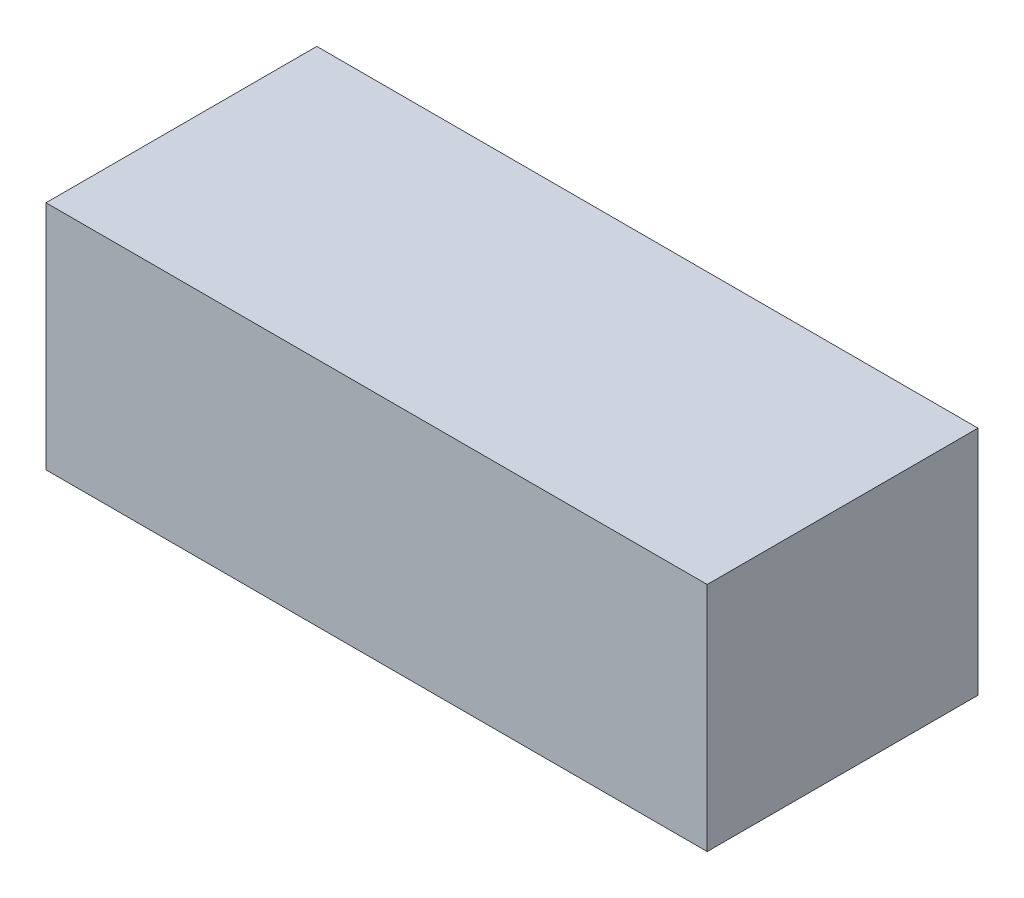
ISO-10303-21;
HEADER;
FILE_DESCRIPTION(('STEP AP214'),'2;1');
FILE_NAME('part.step','',(''),(''),'','','');
FILE_SCHEMA(('AUTOMOTIVE_DESIGN { 1 0 10303 214 1 1 1 1 }'));
ENDSEC;
DATA;
#1=APPLICATION_CONTEXT('core data for automotive mechanical design processes');
#2=APPLICATION_PROTOCOL_DEFINITION('international standard','automotive_design',2000,#1);
#3=PRODUCT_CONTEXT('',#1,'mechanical');
#4=PRODUCT('Part','Part','',(#3));
#5=PRODUCT_RELATED_PRODUCT_CATEGORY('part','',(#4));
#6=PRODUCT_DEFINITION_FORMATION('','',#4);
#7=PRODUCT_DEFINITION_CONTEXT('part definition',#1,'design');
#8=PRODUCT_DEFINITION('design','',#6,#7);
#9=PRODUCT_DEFINITION_SHAPE('','',#8);
#10=(LENGTH_UNIT() NAMED_UNIT(*) SI_UNIT(.MILLI.,.METRE.));
#11=(NAMED_UNIT(*) PLANE_ANGLE_UNIT() SI_UNIT($,.RADIAN.));
#12=(NAMED_UNIT(*) SI_UNIT($,.STERADIAN.) SOLID_ANGLE_UNIT());
#13=UNCERTAINTY_MEASURE_WITH_UNIT(LENGTH_MEASURE(1.E-05),#10,'distance_accuracy_value','');
#14=(GEOMETRIC_REPRESENTATION_CONTEXT(3) GLOBAL_UNCERTAINTY_ASSIGNED_CONTEXT((#13)) GLOBAL_UNIT_ASSIGNED_CONTEXT((#10,
#11,#12)) REPRESENTATION_CONTEXT('',''));
#15=CARTESIAN_POINT('',(0.,0.,0.));
#16=DIRECTION('',(0.,0.,1.));
#17=DIRECTION('',(1.,0.,0.));
#18=AXIS2_PLACEMENT_3D('',#15,#16,#17);
#19=CARTESIAN_POINT('',(-46.3028328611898,11.3115765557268,18.9644581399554));
#20=CARTESIAN_POINT('',(-46.3028328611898,8.56284130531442,16.5691920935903));
#21=CARTESIAN_POINT('',(-46.3028328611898,-1.00895184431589,8.2282683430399));
#22=CARTESIAN_POINT('',(-46.3028328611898,28.0136302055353,-2.1906683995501));
#23=CARTESIAN_POINT('',(-46.3028328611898,18.0505399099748,-14.1460973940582));
#24=CARTESIAN_POINT('',(-46.3028328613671,14.0351454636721,-18.9644581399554));
#25=CARTESIAN_POINT('',(-42.0859620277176,14.8657909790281,18.9644581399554));
#26=CARTESIAN_POINT('',(-41.939173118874,12.1447775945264,16.5664255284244));
#27=CARTESIAN_POINT('',(-41.4280169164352,2.66951901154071,8.21586789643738));
#28=CARTESIAN_POINT('',(-40.670869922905,29.6947584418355,-2.31325626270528));
#29=CARTESIAN_POINT('',(-40.0605118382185,19.7742895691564,-14.181311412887));
#30=CARTESIAN_POINT('',(-39.8145210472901,15.7760727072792,-18.9644581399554));
#31=CARTESIAN_POINT('',(-33.161918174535,22.3874739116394,18.9644581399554));
#32=CARTESIAN_POINT('',(-32.7431108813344,19.6859802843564,16.5605707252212));
#33=CARTESIAN_POINT('',(-31.284717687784,10.2786944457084,8.18962518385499));
#34=CARTESIAN_POINT('',(-29.1244817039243,32.8750904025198,-2.57268547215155));
#35=CARTESIAN_POINT('',(-27.3830530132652,22.8820431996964,-14.2558338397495));
#36=CARTESIAN_POINT('',(-26.6812102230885,18.8545753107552,-18.9644581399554));
#37=CARTESIAN_POINT('',(-10.2840590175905,1.15424075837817,18.9644581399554));
#38=CARTESIAN_POINT('',(-9.48633213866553,0.848685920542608,16.5463922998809));
#39=CARTESIAN_POINT('',(-6.70844486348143,-0.215333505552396,8.12607388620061));
#40=CARTESIAN_POINT('',(-2.5937163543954,23.7704347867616,-3.20093847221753));
#41=CARTESIAN_POINT('',(0.723285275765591,23.3675461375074,-14.436302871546));
#42=CARTESIAN_POINT('',(2.0601265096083,23.2051711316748,-18.9644581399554));
#43=CARTESIAN_POINT('',(16.8922424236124,30.2982164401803,18.9644581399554));
#44=CARTESIAN_POINT('',(17.5784296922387,28.8164494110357,16.5305453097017));
#45=CARTESIAN_POINT('',(19.9679077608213,23.6565608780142,8.05504365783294));
#46=CARTESIAN_POINT('',(23.5073075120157,29.3154346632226,-3.90312640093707));
#47=CARTESIAN_POINT('',(26.3605199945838,23.6056469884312,-14.6380101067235));
#48=CARTESIAN_POINT('',(27.5104416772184,21.3044483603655,-18.9644581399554));
#49=CARTESIAN_POINT('',(38.7164256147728,21.5374299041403,18.9644581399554));
#50=CARTESIAN_POINT('',(38.9282346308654,20.7977552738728,16.5177865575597));
#51=CARTESIAN_POINT('',(39.6658073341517,18.222020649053,7.99785569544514));
#52=CARTESIAN_POINT('',(40.7583323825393,17.8379369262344,-4.46847298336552));
#53=CARTESIAN_POINT('',(41.6390484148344,14.8787836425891,-14.8004089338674));
#54=CARTESIAN_POINT('',(41.9940007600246,13.6861649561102,-18.9644581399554));
#55=CARTESIAN_POINT('',(46.3028328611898,18.4920515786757,18.9644581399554));
#56=CARTESIAN_POINT('',(46.3028328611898,17.9627990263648,16.5133514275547));
#57=CARTESIAN_POINT('',(46.3028328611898,16.1198074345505,7.97797631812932));
#58=CARTESIAN_POINT('',(46.3028328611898,13.3898874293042,-4.66499577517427));
#59=CARTESIAN_POINT('',(46.3028328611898,11.1892199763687,-14.8568611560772));
#60=CARTESIAN_POINT('',(46.3028328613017,10.3022915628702,-18.9644581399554));
#61=B_SPLINE_SURFACE_WITH_KNOTS('',3,3,((#19,#20,#21,#22,#23,#24),(#25,#26,#27,#28,#29,#30),
(#31,#32,#33,#34,#35,#36),(#37,#38,#39,#40,#41,#42),(#43,#44,#45,#46,#47,#48),(#49,#50,#51,#52,
#53,#54),(#55,#56,#57,#58,#59,#60)),.UNSPECIFIED.,.F.,.F.,.F.,(4,1,1,1,4),(4,1,1,4),(0.,
0.148631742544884,0.314545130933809,0.761725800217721,1.),(0.,0.193871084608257,
0.675108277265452,1.),.UNSPECIFIED.);
#62=CARTESIAN_POINT('',(-46.3028328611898,11.3115765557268,18.9644581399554));
#63=CARTESIAN_POINT('',(-42.0859620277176,14.8657909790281,18.9644581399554));
#64=CARTESIAN_POINT('',(-33.161918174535,22.3874739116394,18.9644581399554));
#65=CARTESIAN_POINT('',(-10.2840590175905,1.15424075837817,18.9644581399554));
#66=CARTESIAN_POINT('',(16.8922424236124,30.2982164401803,18.9644581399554));
#67=CARTESIAN_POINT('',(38.7164256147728,21.5374299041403,18.9644581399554));
#68=CARTESIAN_POINT('',(46.3028328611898,18.4920515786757,18.9644581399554));
#69=B_SPLINE_CURVE_WITH_KNOTS('',3,(#62,#63,#64,#65,#66,#67,#68),.UNSPECIFIED.,.F.,.F.,(4,1,1,1,
4),(0.,0.148631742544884,0.314545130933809,0.761725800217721,1.),.UNSPECIFIED.);
#70=CARTESIAN_POINT('',(-46.3028328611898,11.3115765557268,18.9644581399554));
#71=VERTEX_POINT('',#70);
#72=CARTESIAN_POINT('',(46.3028328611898,18.4920515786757,18.9644581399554));
#73=VERTEX_POINT('',#72);
#74=EDGE_CURVE('E13',#71,#73,#69,.T.);
#75=CARTESIAN_POINT('',(46.3028328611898,18.4920515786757,18.9644581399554));
#76=CARTESIAN_POINT('',(46.3028328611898,17.9627990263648,16.5133514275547));
#77=CARTESIAN_POINT('',(46.3028328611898,16.1198074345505,7.97797631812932));
#78=CARTESIAN_POINT('',(46.3028328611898,13.3898874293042,-4.66499577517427));
#79=CARTESIAN_POINT('',(46.3028328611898,11.1892199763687,-14.8568611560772));
#80=CARTESIAN_POINT('',(46.3028328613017,10.3022915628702,-18.9644581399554));
#81=B_SPLINE_CURVE_WITH_KNOTS('',3,(#75,#76,#77,#78,#79,#80),.UNSPECIFIED.,.F.,.F.,(4,1,1,4),
(0.,0.193871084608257,0.675108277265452,1.),.UNSPECIFIED.);
#82=CARTESIAN_POINT('',(46.3028328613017,10.3022915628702,-18.9644581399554));
#83=VERTEX_POINT('',#82);
#84=EDGE_CURVE('E73',#73,#83,#81,.T.);
#85=CARTESIAN_POINT('',(-46.3028328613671,14.0351454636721,-18.9644581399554));
#86=CARTESIAN_POINT('',(-39.8145210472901,15.7760727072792,-18.9644581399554));
#87=CARTESIAN_POINT('',(-26.6812102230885,18.8545753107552,-18.9644581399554));
#88=CARTESIAN_POINT('',(2.0601265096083,23.2051711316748,-18.9644581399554));
#89=CARTESIAN_POINT('',(27.5104416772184,21.3044483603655,-18.9644581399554));
#90=CARTESIAN_POINT('',(41.9940007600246,13.6861649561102,-18.9644581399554));
#91=CARTESIAN_POINT('',(46.3028328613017,10.3022915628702,-18.9644581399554));
#92=B_SPLINE_CURVE_WITH_KNOTS('',3,(#85,#86,#87,#88,#89,#90,#91),.UNSPECIFIED.,.F.,.F.,(4,1,1,1,
4),(0.,0.148631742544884,0.314545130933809,0.761725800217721,1.),.UNSPECIFIED.);
#93=CARTESIAN_POINT('',(-46.3028328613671,14.0351454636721,-18.9644581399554));
#94=VERTEX_POINT('',#93);
#95=EDGE_CURVE('E81',#83,#94,#92,.F.);
#96=CARTESIAN_POINT('',(-46.3028328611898,11.3115765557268,18.9644581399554));
#97=CARTESIAN_POINT('',(-46.3028328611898,8.56284130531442,16.5691920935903));
#98=CARTESIAN_POINT('',(-46.3028328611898,-1.00895184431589,8.2282683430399));
#99=CARTESIAN_POINT('',(-46.3028328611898,28.0136302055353,-2.1906683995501));
#100=CARTESIAN_POINT('',(-46.3028328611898,18.0505399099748,-14.1460973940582));
#101=CARTESIAN_POINT('',(-46.3028328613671,14.0351454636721,-18.9644581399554));
#102=B_SPLINE_CURVE_WITH_KNOTS('',3,(#96,#97,#98,#99,#100,#101),.UNSPECIFIED.,.F.,.F.,(4,1,1,4),
(0.,0.193871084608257,0.675108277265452,1.),.UNSPECIFIED.);
#103=EDGE_CURVE('E65',#94,#71,#102,.F.);
#104=ORIENTED_EDGE('',*,*,#74,.T.);
#105=ORIENTED_EDGE('',*,*,#84,.T.);
#106=ORIENTED_EDGE('',*,*,#95,.T.);
#107=ORIENTED_EDGE('',*,*,#103,.T.);
#108=EDGE_LOOP('',(#104,#105,#106,#107));
#109=FACE_BOUND('',#108,.T.);
#110=ADVANCED_FACE('F62',(#109),#61,.T.);
#111=OPEN_SHELL('',(#110));
#112=SHELL_BASED_SURFACE_MODEL('B2',(#111));
#113=CARTESIAN_POINT('',(-46.3028328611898,32.4,18.9644581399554));
#114=DIRECTION('',(1.,0.,0.));
#115=DIRECTION('',(0.,0.,-1.));
#116=AXIS2_PLACEMENT_3D('',#113,#114,#115);
#117=PLANE('',#116);
#118=DIRECTION('',(0.,0.,1.));
#119=VECTOR('',#118,1.);
#120=CARTESIAN_POINT('',(-46.3028328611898,0.,18.9644581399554));
#121=LINE('',#120,#119);
#122=CARTESIAN_POINT('',(-46.3028328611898,0.,-18.9644581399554));
#123=VERTEX_POINT('',#122);
#124=CARTESIAN_POINT('',(-46.3028328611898,0.,18.9644581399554));
#125=VERTEX_POINT('',#124);
#126=EDGE_CURVE('E174',#123,#125,#121,.T.);
#127=ORIENTED_EDGE('',*,*,#126,.T.);
#128=DIRECTION('',(0.,-1.,0.));
#129=VECTOR('',#128,1.);
#130=CARTESIAN_POINT('',(-46.3028328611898,32.4,18.9644581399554));
#131=LINE('',#130,#129);
#132=CARTESIAN_POINT('',(-46.3028328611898,32.4,18.9644581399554));
#133=VERTEX_POINT('',#132);
#134=EDGE_CURVE('E60',#133,#125,#131,.T.);
#135=ORIENTED_EDGE('',*,*,#134,.F.);
#136=DIRECTION('',(0.,0.,1.));
#137=VECTOR('',#136,1.);
#138=CARTESIAN_POINT('',(-46.3028328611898,32.4,18.9644581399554));
#139=LINE('',#138,#137);
#140=CARTESIAN_POINT('',(-46.3028328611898,32.4,-18.9644581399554));
#141=VERTEX_POINT('',#140);
#142=EDGE_CURVE('E192',#141,#133,#139,.T.);
#143=ORIENTED_EDGE('',*,*,#142,.F.);
#144=DIRECTION('',(0.,-1.,0.));
#145=VECTOR('',#144,1.);
#146=CARTESIAN_POINT('',(-46.3028328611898,32.4,-18.9644581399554));
#147=LINE('',#146,#145);
#148=EDGE_CURVE('E186',#141,#123,#147,.T.);
#149=ORIENTED_EDGE('',*,*,#148,.T.);
#150=EDGE_LOOP('',(#127,#135,#143,#149));
#151=FACE_BOUND('',#150,.T.);
#152=ADVANCED_FACE('F130',(#151),#117,.F.);
#153=CARTESIAN_POINT('',(-46.3028328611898,32.4,18.9644581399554));
#154=DIRECTION('',(0.,0.,-1.));
#155=DIRECTION('',(-1.,0.,0.));
#156=AXIS2_PLACEMENT_3D('',#153,#154,#155);
#157=PLANE('',#156);
#158=DIRECTION('',(1.,0.,0.));
#159=VECTOR('',#158,1.);
#160=CARTESIAN_POINT('',(-46.3028328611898,0.,18.9644581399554));
#161=LINE('',#160,#159);
#162=CARTESIAN_POINT('',(46.3028328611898,0.,18.9644581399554));
#163=VERTEX_POINT('',#162);
#164=EDGE_CURVE('E170',#125,#163,#161,.T.);
#165=ORIENTED_EDGE('',*,*,#164,.T.);
#166=DIRECTION('',(0.,-1.,0.));
#167=VECTOR('',#166,1.);
#168=CARTESIAN_POINT('',(46.3028328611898,32.4,18.9644581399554));
#169=LINE('',#168,#167);
#170=CARTESIAN_POINT('',(46.3028328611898,32.4,18.9644581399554));
#171=VERTEX_POINT('',#170);
#172=EDGE_CURVE('E137',#171,#163,#169,.T.);
#173=ORIENTED_EDGE('',*,*,#172,.F.);
#174=DIRECTION('',(1.,0.,0.));
#175=VECTOR('',#174,1.);
#176=CARTESIAN_POINT('',(-46.3028328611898,32.4,18.9644581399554));
#177=LINE('',#176,#175);
#178=EDGE_CURVE('E182',#133,#171,#177,.T.);
#179=ORIENTED_EDGE('',*,*,#178,.F.);
#180=ORIENTED_EDGE('',*,*,#134,.T.);
#181=EDGE_LOOP('',(#165,#173,#179,#180));
#182=FACE_BOUND('',#181,.T.);
#183=ADVANCED_FACE('F181',(#182),#157,.F.);
#184=CARTESIAN_POINT('',(46.3028328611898,32.4,18.9644581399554));
#185=DIRECTION('',(-1.,0.,0.));
#186=DIRECTION('',(0.,0.,1.));
#187=AXIS2_PLACEMENT_3D('',#184,#185,#186);
#188=PLANE('',#187);
#189=DIRECTION('',(0.,0.,-1.));
#190=VECTOR('',#189,1.);
#191=CARTESIAN_POINT('',(46.3028328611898,0.,18.9644581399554));
#192=LINE('',#191,#190);
#193=CARTESIAN_POINT('',(46.3028328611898,0.,-18.9644581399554));
#194=VERTEX_POINT('',#193);
#195=EDGE_CURVE('E175',#163,#194,#192,.T.);
#196=ORIENTED_EDGE('',*,*,#195,.T.);
#197=DIRECTION('',(0.,-1.,0.));
#198=VECTOR('',#197,1.);
#199=CARTESIAN_POINT('',(46.3028328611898,32.4,-18.9644581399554));
#200=LINE('',#199,#198);
#201=CARTESIAN_POINT('',(46.3028328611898,32.4,-18.9644581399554));
#202=VERTEX_POINT('',#201);
#203=EDGE_CURVE('E198',#202,#194,#200,.T.);
#204=ORIENTED_EDGE('',*,*,#203,.F.);
#205=DIRECTION('',(0.,0.,-1.));
#206=VECTOR('',#205,1.);
#207=CARTESIAN_POINT('',(46.3028328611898,32.4,18.9644581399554));
#208=LINE('',#207,#206);
#209=EDGE_CURVE('E149',#171,#202,#208,.T.);
#210=ORIENTED_EDGE('',*,*,#209,.F.);
#211=ORIENTED_EDGE('',*,*,#172,.T.);
#212=EDGE_LOOP('',(#196,#204,#210,#211));
#213=FACE_BOUND('',#212,.T.);
#214=ADVANCED_FACE('F201',(#213),#188,.F.);
#215=CARTESIAN_POINT('',(-46.3028328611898,32.4,-18.9644581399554));
#216=DIRECTION('',(0.,0.,1.));
#217=DIRECTION('',(1.,0.,0.));
#218=AXIS2_PLACEMENT_3D('',#215,#216,#217);
#219=PLANE('',#218);
#220=DIRECTION('',(-1.,0.,0.));
#221=VECTOR('',#220,1.);
#222=CARTESIAN_POINT('',(-46.3028328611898,0.,-18.9644581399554));
#223=LINE('',#222,#221);
#224=EDGE_CURVE('E190',#194,#123,#223,.T.);
#225=ORIENTED_EDGE('',*,*,#224,.T.);
#226=ORIENTED_EDGE('',*,*,#148,.F.);
#227=DIRECTION('',(-1.,0.,0.));
#228=VECTOR('',#227,1.);
#229=CARTESIAN_POINT('',(-46.3028328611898,32.4,-18.9644581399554));
#230=LINE('',#229,#228);
#231=EDGE_CURVE('E144',#202,#141,#230,.T.);
#232=ORIENTED_EDGE('',*,*,#231,.F.);
#233=ORIENTED_EDGE('',*,*,#203,.T.);
#234=EDGE_LOOP('',(#225,#226,#232,#233));
#235=FACE_BOUND('',#234,.T.);
#236=ADVANCED_FACE('F203',(#235),#219,.F.);
#237=CARTESIAN_POINT('',(-46.3028328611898,32.4,-18.9644581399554));
#238=DIRECTION('',(0.,-1.,0.));
#239=DIRECTION('',(0.,0.,-1.));
#240=AXIS2_PLACEMENT_3D('',#237,#238,#239);
#241=PLANE('',#240);
#242=ORIENTED_EDGE('',*,*,#142,.T.);
#243=ORIENTED_EDGE('',*,*,#178,.T.);
#244=ORIENTED_EDGE('',*,*,#209,.T.);
#245=ORIENTED_EDGE('',*,*,#231,.T.);
#246=EDGE_LOOP('',(#242,#243,#244,#245));
#247=FACE_BOUND('',#246,.T.);
#248=ADVANCED_FACE('F204',(#247),#241,.F.);
#249=CARTESIAN_POINT('',(-46.3028328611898,0.,-18.9644581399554));
#250=DIRECTION('',(0.,-1.,0.));
#251=DIRECTION('',(0.,0.,-1.));
#252=AXIS2_PLACEMENT_3D('',#249,#250,#251);
#253=PLANE('',#252);
#254=ORIENTED_EDGE('',*,*,#126,.F.);
#255=ORIENTED_EDGE('',*,*,#224,.F.);
#256=ORIENTED_EDGE('',*,*,#195,.F.);
#257=ORIENTED_EDGE('',*,*,#164,.F.);
#258=EDGE_LOOP('',(#254,#255,#256,#257));
#259=FACE_BOUND('',#258,.T.);
#260=ADVANCED_FACE('F171',(#259),#253,.T.);
#261=CLOSED_SHELL('',(#152,#183,#214,#236,#248,#260));
#262=MANIFOLD_SOLID_BREP('B7',#261);
#263=ADVANCED_BREP_SHAPE_REPRESENTATION('',(#18,#262),#14);
#264=MANIFOLD_SURFACE_SHAPE_REPRESENTATION('',(#18,#112),#14);
#265=SHAPE_REPRESENTATION('',(#18),#14);
#266=SHAPE_DEFINITION_REPRESENTATION(#9,#265);
#267=SHAPE_REPRESENTATION_RELATIONSHIP('','',#265,#263);
#268=SHAPE_REPRESENTATION_RELATIONSHIP('','',#265,#264);
ENDSEC;
END-ISO-10303-21;
